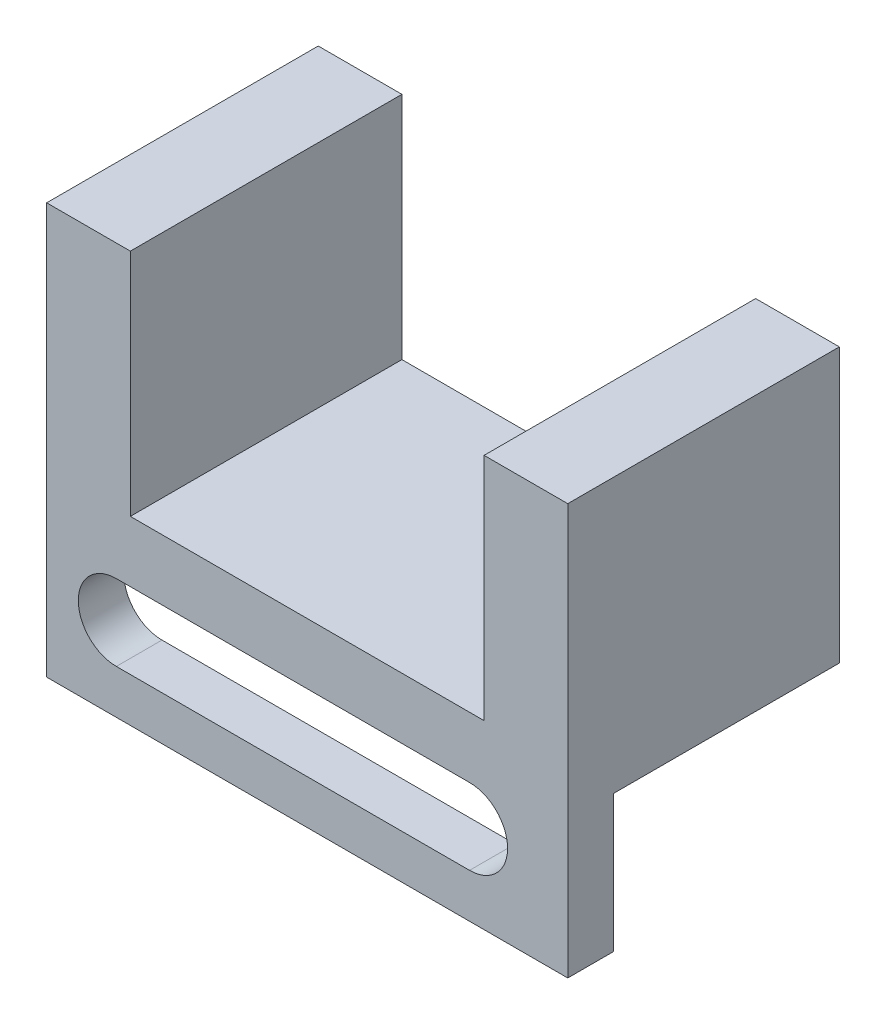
from build123d import *

# Parameters (mm, degrees)
BOSS_EXTRUDE1_DEPTH = 17.85
SKETCH5_R           = 1
CUT_EXTRUDE1_DEPTH  = 10
SKETCH6_W           = 34.25
SKETCH6_H           = 9
BOSS_EXTRUDE2_DEPTH = 3


with BuildPart() as part:
    # Sketch4 → Boss-Extrude1 (new body)
    with BuildSketch(Plane(origin=(0, 0, -70.608208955), x_dir=(-1, 0, 0), z_dir=(0, 0, -1))):
        Polygon((-69.066917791, 81.5), (-45.816917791, 81.5), (-45.816917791, 96.6), (-40.316917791, 96.6), (-40.316917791, 78.6), (-74.566917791, 78.6), (-74.566917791, 96.6), (-69.066917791, 96.6), align=None)
    extrude(amount=BOSS_EXTRUDE1_DEPTH)

    # Sketch5 → Cut-Extrude1 (cut)
    with BuildSketch(Plane(origin=(0, 0, -88.458208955), x_dir=(-1, 0, 0), z_dir=(0, 0, -1))):
        with Locations((-43.741917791, 88)):
            Circle(SKETCH5_R)
        with Locations((-71.141917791, 88)):
            Circle(SKETCH5_R)
    extrude(amount=-CUT_EXTRUDE1_DEPTH, mode=Mode.SUBTRACT)

    # Sketch6 → Boss-Extrude2 (add)
    with BuildSketch(Plane(origin=(0, 0, -70.608208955), x_dir=(-1, 0, 0), z_dir=(0, 0, -1))):
        with Locations((-57.441917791, 74.1)):
            Rectangle(SKETCH6_W, SKETCH6_H)
        with BuildLine():
            Line((-68.111940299, 77.5), (-44.896828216, 77.5))
            ThreePointArc((-44.896828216, 77.5), (-42.396828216, 75), (-44.896828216, 72.5))
            Line((-44.896828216, 72.5), (-68.111940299, 72.5))
            ThreePointArc((-68.111940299, 72.5), (-70.611940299, 75), (-68.111940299, 77.5))
        make_face(mode=Mode.SUBTRACT)
    extrude(amount=BOSS_EXTRUDE2_DEPTH)


solid = part.part
